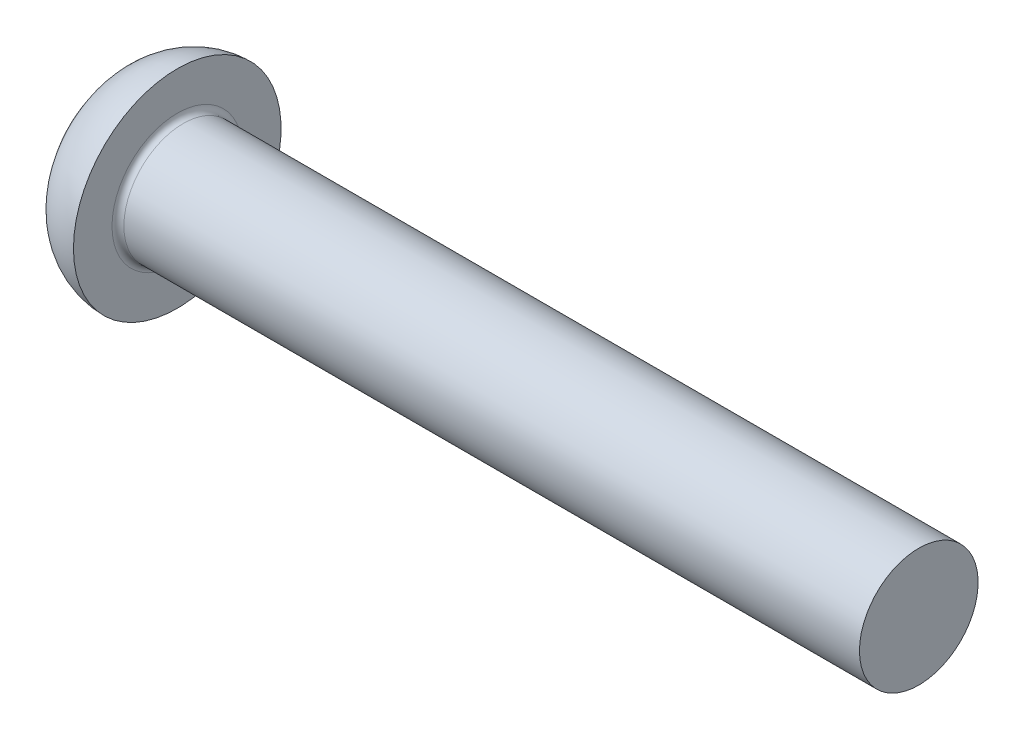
from build123d import *

# Parameters (mm, degrees)
FILLET1_R    = 0.4
RECPAT_COUNT = 2
RECPAT_ANGLE = 90


with BuildPart() as part:
    # BodySke → BaseBody (revolve)
    with BuildSketch(Plane.XY, mode=Mode.PRIVATE) as basebody_sk:
        with BuildLine():
            Line((5.4, 4), (5.4, 7))
            ThreePointArc((5.4, 7), (3.455602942, 6.543518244), (1.887955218, 5.30596577))
            ThreePointArc((1.887955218, 5.30596577), (0.486051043, 2.815921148), (0, 0))
            Line((0, 0), (55.4, 0))
            Line((55.4, 0), (55.4, 4))
            Line((55.4, 4), (5.4, 4))
        make_face()
    revolve(basebody_sk.sketch.rotate(Axis((0, 0, 0), (1, 0, 0)), 90), axis=Axis((0, 0, 0), (1, 0, 0)))

    # Fillet1
    fillet1_edges = [part.edges().sort_by_distance(p)[0] for p in [
        (5.4, 0, -4),
    ]]
    fillet(fillet1_edges, radius=FILLET1_R)

    # RecSkeTop → Recess section 0
    with BuildSketch(Plane(origin=(0, 0, 0), x_dir=(0, 0, -1), z_dir=(1, 0, 0))):
        with BuildLine():
            Line((-0.847, 3.85), (0.847, 3.85))
            Line((0.847, 3.85), (0.847, -3.85))
            Line((0.847, -3.85), (-0.847, -3.85))
            Line((-0.847, -3.85), (-0.847, 3.85))
        make_face()
    # RecSkeBot → Recess section 1
    with BuildSketch(Plane(origin=(4.26, 0, 0), x_dir=(0, 0, -1), z_dir=(1, 0, 0))):
        with BuildLine():
            Line((-0.847, 1.726042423), (0.847, 1.726042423))
            Line((0.847, 1.726042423), (0.847, -1.726042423))
            Line((0.847, -1.726042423), (-0.847, -1.726042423))
            Line((-0.847, -1.726042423), (-0.847, 1.726042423))
        make_face()
    recess = loft(mode=Mode.SUBTRACT)

    # RecPat: Recess ×2 about axis
    recpat_axis = Axis((0, 0, 0), (1, 0, 0))
    for i in range(1, RECPAT_COUNT):
        add(recess.rotate(recpat_axis, i * RECPAT_ANGLE / (RECPAT_COUNT - 1)), mode=Mode.SUBTRACT)

    # RecCorSke → RecessCore (revolve, cut)
    with BuildSketch(Plane.XY, mode=Mode.PRIVATE) as recesscore_sk:
        Polygon((0, 0), (0, 1.8634), (4.26, 1.565511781), (4.768665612, 0), align=None)
    revolve(recesscore_sk.sketch.rotate(Axis((0, 0, 0), (1, 0, 0)), 90), axis=Axis((0, 0, 0), (1, 0, 0)), mode=Mode.SUBTRACT)


solid = part.part
